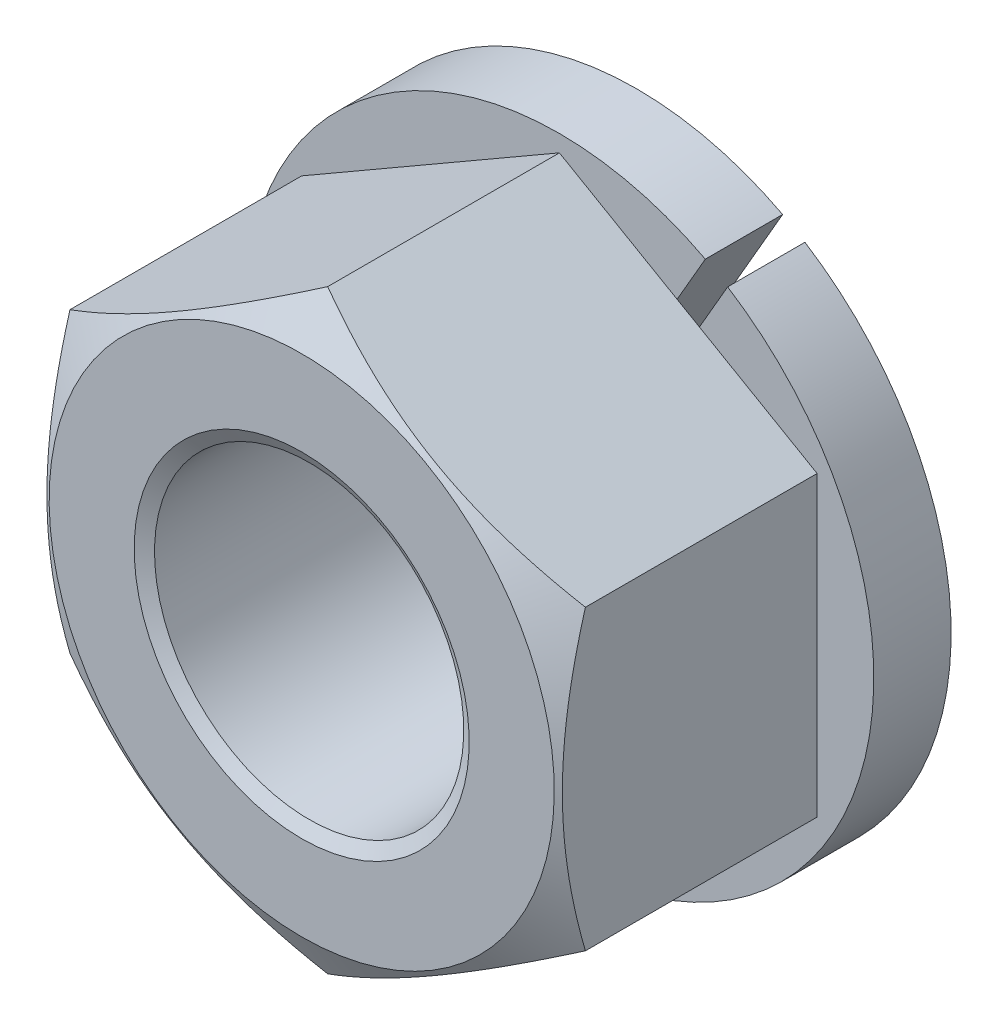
ISO-10303-21;
HEADER;
FILE_DESCRIPTION(('STEP AP214'),'2;1');
FILE_NAME('part.step','',(''),(''),'','','');
FILE_SCHEMA(('AUTOMOTIVE_DESIGN { 1 0 10303 214 1 1 1 1 }'));
ENDSEC;
DATA;
#1=APPLICATION_CONTEXT('core data for automotive mechanical design processes');
#2=APPLICATION_PROTOCOL_DEFINITION('international standard','automotive_design',2000,#1);
#3=PRODUCT_CONTEXT('',#1,'mechanical');
#4=PRODUCT('Part','Part','',(#3));
#5=PRODUCT_RELATED_PRODUCT_CATEGORY('part','',(#4));
#6=PRODUCT_DEFINITION_FORMATION('','',#4);
#7=PRODUCT_DEFINITION_CONTEXT('part definition',#1,'design');
#8=PRODUCT_DEFINITION('design','',#6,#7);
#9=PRODUCT_DEFINITION_SHAPE('','',#8);
#10=(LENGTH_UNIT() NAMED_UNIT(*) SI_UNIT(.MILLI.,.METRE.));
#11=(NAMED_UNIT(*) PLANE_ANGLE_UNIT() SI_UNIT($,.RADIAN.));
#12=(NAMED_UNIT(*) SI_UNIT($,.STERADIAN.) SOLID_ANGLE_UNIT());
#13=UNCERTAINTY_MEASURE_WITH_UNIT(LENGTH_MEASURE(1.E-05),#10,'distance_accuracy_value','');
#14=(GEOMETRIC_REPRESENTATION_CONTEXT(3) GLOBAL_UNCERTAINTY_ASSIGNED_CONTEXT((#13)) GLOBAL_UNIT_ASSIGNED_CONTEXT((#10,
#11,#12)) REPRESENTATION_CONTEXT('',''));
#15=CARTESIAN_POINT('',(0.,0.,0.));
#16=DIRECTION('',(0.,0.,1.));
#17=DIRECTION('',(1.,0.,0.));
#18=AXIS2_PLACEMENT_3D('',#15,#16,#17);
#19=CARTESIAN_POINT('',(5.,-2.88675134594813,1.5));
#20=DIRECTION('',(0.,0.,1.));
#21=DIRECTION('',(-0.866025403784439,0.5,0.));
#22=AXIS2_PLACEMENT_3D('',#19,#20,#21);
#23=PLANE('',#22);
#24=DIRECTION('',(0.5,0.866025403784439,0.));
#25=VECTOR('',#24,1.);
#26=CARTESIAN_POINT('',(1.73637476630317,2.50748931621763,1.5));
#27=LINE('',#26,#25);
#28=CARTESIAN_POINT('',(1.83669152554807,2.68124304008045,1.5));
#29=VERTEX_POINT('',#28);
#30=CARTESIAN_POINT('',(2.71650635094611,4.20512701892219,1.5));
#31=VERTEX_POINT('',#30);
#32=EDGE_CURVE('E9',#29,#31,#27,.T.);
#33=ORIENTED_EDGE('',*,*,#32,.F.);
#34=CARTESIAN_POINT('',(0.,0.,1.5));
#35=DIRECTION('',(0.,0.,1.));
#36=DIRECTION('',(-0.866025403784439,0.5,0.));
#37=AXIS2_PLACEMENT_3D('',#34,#35,#36);
#38=CIRCLE('',#37,3.25);
#39=CARTESIAN_POINT('',(1.40367882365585,2.93124304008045,1.5));
#40=VERTEX_POINT('',#39);
#41=EDGE_CURVE('E315',#29,#40,#38,.T.);
#42=ORIENTED_EDGE('',*,*,#41,.T.);
#43=DIRECTION('',(-0.5,-0.866025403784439,0.));
#44=VECTOR('',#43,1.);
#45=CARTESIAN_POINT('',(1.30336206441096,2.75748931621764,1.5));
#46=LINE('',#45,#44);
#47=CARTESIAN_POINT('',(2.28349364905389,4.45512701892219,1.5));
#48=VERTEX_POINT('',#47);
#49=EDGE_CURVE('E24',#48,#40,#46,.T.);
#50=ORIENTED_EDGE('',*,*,#49,.F.);
#51=DIRECTION('',(-0.866025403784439,0.5,0.));
#52=VECTOR('',#51,1.);
#53=CARTESIAN_POINT('',(5.,2.88675134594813,1.5));
#54=LINE('',#53,#52);
#55=EDGE_CURVE('E311',#31,#48,#54,.T.);
#56=ORIENTED_EDGE('',*,*,#55,.F.);
#57=EDGE_LOOP('',(#33,#42,#50,#56));
#58=FACE_BOUND('',#57,.T.);
#59=ADVANCED_FACE('F14',(#58),#23,.F.);
#60=CARTESIAN_POINT('',(0.,-5.77350269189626,6.5));
#61=DIRECTION('',(-0.5,0.866025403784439,0.));
#62=DIRECTION('',(-0.866025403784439,-0.5,0.));
#63=AXIS2_PLACEMENT_3D('',#60,#61,#62);
#64=PLANE('',#63);
#65=CARTESIAN_POINT('',(-0.000199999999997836,-5.7736181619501,5.99561631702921));
#66=CARTESIAN_POINT('',(0.219534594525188,-5.64675433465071,6.0688784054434));
#67=CARTESIAN_POINT('',(0.441148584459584,-5.5188054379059,6.13551365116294));
#68=CARTESIAN_POINT('',(0.888213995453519,-5.26069210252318,6.25182598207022));
#69=CARTESIAN_POINT('',(1.11367335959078,-5.13052307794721,6.30146192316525));
#70=CARTESIAN_POINT('',(1.56183230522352,-4.87177839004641,6.37871394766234));
#71=CARTESIAN_POINT('',(1.7844620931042,-4.74324302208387,6.40684459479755));
#72=CARTESIAN_POINT('',(2.11918990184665,-4.54998783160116,6.43207005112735));
#73=CARTESIAN_POINT('',(2.23084219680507,-4.48552534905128,6.43765151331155));
#74=CARTESIAN_POINT('',(2.45424997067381,-4.35654081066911,6.44306275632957));
#75=CARTESIAN_POINT('',(2.56600544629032,-4.2920187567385,6.44289271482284));
#76=CARTESIAN_POINT('',(2.87218423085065,-4.11524635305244,6.43451134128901));
#77=CARTESIAN_POINT('',(3.06650608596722,-4.00305457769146,6.42043520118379));
#78=CARTESIAN_POINT('',(3.45386010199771,-3.77941563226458,6.3757997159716));
#79=CARTESIAN_POINT('',(3.64689090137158,-3.66796924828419,6.34522511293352));
#80=CARTESIAN_POINT('',(4.03502534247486,-3.44387972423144,6.26879647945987));
#81=CARTESIAN_POINT('',(4.23007999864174,-3.3312648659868,6.22261859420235));
#82=CARTESIAN_POINT('',(4.61728034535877,-3.10771464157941,6.1178131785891));
#83=CARTESIAN_POINT('',(4.80943099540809,-2.99677641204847,6.05921026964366));
#84=CARTESIAN_POINT('',(5.0002,-2.88663587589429,5.99561631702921));
#85=B_SPLINE_CURVE_WITH_KNOTS('',3,(#65,#66,#67,#68,#69,#70,#71,#72,#73,#74,#75,#76,#77,#78,#79,
#80,#81,#82,#83,#84),.UNSPECIFIED.,.F.,.F.,(4,2,2,2,2,2,2,2,2,4),(0.,0.792555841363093,
1.58701660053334,2.36181537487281,2.74884076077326,3.13585419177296,3.8096236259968,
4.48401723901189,5.17336882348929,5.86136694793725),.UNSPECIFIED.);
#86=CARTESIAN_POINT('',(2.16081492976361E-13,-5.77350269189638,5.995682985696));
#87=VERTEX_POINT('',#86);
#88=CARTESIAN_POINT('',(5.,-2.88675134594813,5.99568298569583));
#89=VERTEX_POINT('',#88);
#90=EDGE_CURVE('E214',#87,#89,#85,.T.);
#91=ORIENTED_EDGE('',*,*,#90,.F.);
#92=DIRECTION('',(0.,0.,-1.));
#93=VECTOR('',#92,1.);
#94=CARTESIAN_POINT('',(0.,-5.77350269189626,6.5));
#95=LINE('',#94,#93);
#96=CARTESIAN_POINT('',(0.,-5.77350269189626,1.5));
#97=VERTEX_POINT('',#96);
#98=EDGE_CURVE('E302',#87,#97,#95,.T.);
#99=ORIENTED_EDGE('',*,*,#98,.T.);
#100=DIRECTION('',(0.866025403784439,0.5,0.));
#101=VECTOR('',#100,1.);
#102=CARTESIAN_POINT('',(0.,-5.77350269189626,1.5));
#103=LINE('',#102,#101);
#104=CARTESIAN_POINT('',(5.,-2.88675134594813,1.5));
#105=VERTEX_POINT('',#104);
#106=EDGE_CURVE('E289',#97,#105,#103,.T.);
#107=ORIENTED_EDGE('',*,*,#106,.T.);
#108=DIRECTION('',(0.,0.,-1.));
#109=VECTOR('',#108,1.);
#110=CARTESIAN_POINT('',(5.,-2.88675134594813,6.5));
#111=LINE('',#110,#109);
#112=EDGE_CURVE('E286',#89,#105,#111,.T.);
#113=ORIENTED_EDGE('',*,*,#112,.F.);
#114=EDGE_LOOP('',(#91,#99,#107,#113));
#115=FACE_BOUND('',#114,.T.);
#116=ADVANCED_FACE('F16',(#115),#64,.F.);
#117=CARTESIAN_POINT('',(5.,-2.88675134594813,6.5));
#118=DIRECTION('',(-1.,0.,0.));
#119=DIRECTION('',(0.,-1.,0.));
#120=AXIS2_PLACEMENT_3D('',#117,#118,#119);
#121=PLANE('',#120);
#122=CARTESIAN_POINT('',(5.,-2.8869822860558,5.99561631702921));
#123=CARTESIAN_POINT('',(5.,-2.63325463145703,6.0688784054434));
#124=CARTESIAN_POINT('',(5.,-2.37735683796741,6.13551365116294));
#125=CARTESIAN_POINT('',(5.,-1.86113016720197,6.25182598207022));
#126=CARTESIAN_POINT('',(5.,-1.60079211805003,6.30146192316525));
#127=CARTESIAN_POINT('',(5.,-1.08330274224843,6.37871394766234));
#128=CARTESIAN_POINT('',(5.,-0.826232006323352,6.40684459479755));
#129=CARTESIAN_POINT('',(5.,-0.439721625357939,6.43207005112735));
#130=CARTESIAN_POINT('',(5.,-0.310796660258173,6.43765151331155));
#131=CARTESIAN_POINT('',(5.,-0.0528275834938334,6.44306275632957));
#132=CARTESIAN_POINT('',(5.,0.0762165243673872,6.44289271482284));
#133=CARTESIAN_POINT('',(5.,0.429761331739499,6.43451134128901));
#134=CARTESIAN_POINT('',(5.,0.654144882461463,6.42043520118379));
#135=CARTESIAN_POINT('',(5.,1.10142277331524,6.3757997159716));
#136=CARTESIAN_POINT('',(5.,1.32431554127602,6.34522511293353));
#137=CARTESIAN_POINT('',(5.,1.77249458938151,6.26879647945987));
#138=CARTESIAN_POINT('',(5.,1.99772430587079,6.22261859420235));
#139=CARTESIAN_POINT('',(5.,2.44482475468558,6.1178131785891));
#140=CARTESIAN_POINT('',(5.,2.66670121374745,6.05921026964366));
#141=CARTESIAN_POINT('',(5.,2.8869822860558,5.99561631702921));
#142=B_SPLINE_CURVE_WITH_KNOTS('',3,(#122,#123,#124,#125,#126,#127,#128,#129,#130,#131,#132,
#133,#134,#135,#136,#137,#138,#139,#140,#141),.UNSPECIFIED.,.F.,.F.,(4,2,2,2,2,2,2,2,2,4),(0.,
0.79255584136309,1.58701660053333,2.3618153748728,2.74884076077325,3.13585419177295,
3.80962362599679,4.48401723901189,5.17336882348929,5.86136694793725),.UNSPECIFIED.);
#143=CARTESIAN_POINT('',(5.00000000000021,2.886751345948,5.995682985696));
#144=VERTEX_POINT('',#143);
#145=EDGE_CURVE('E208',#89,#144,#142,.T.);
#146=ORIENTED_EDGE('',*,*,#145,.F.);
#147=ORIENTED_EDGE('',*,*,#112,.T.);
#148=DIRECTION('',(0.,1.,0.));
#149=VECTOR('',#148,1.);
#150=CARTESIAN_POINT('',(5.,-2.88675134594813,1.5));
#151=LINE('',#150,#149);
#152=CARTESIAN_POINT('',(5.,2.88675134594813,1.5));
#153=VERTEX_POINT('',#152);
#154=EDGE_CURVE('E312',#105,#153,#151,.T.);
#155=ORIENTED_EDGE('',*,*,#154,.T.);
#156=DIRECTION('',(0.,0.,-1.));
#157=VECTOR('',#156,1.);
#158=CARTESIAN_POINT('',(5.,2.88675134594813,6.5));
#159=LINE('',#158,#157);
#160=EDGE_CURVE('E287',#144,#153,#159,.T.);
#161=ORIENTED_EDGE('',*,*,#160,.F.);
#162=EDGE_LOOP('',(#146,#147,#155,#161));
#163=FACE_BOUND('',#162,.T.);
#164=ADVANCED_FACE('F220',(#163),#121,.F.);
#165=CARTESIAN_POINT('',(5.,2.88675134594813,6.5));
#166=DIRECTION('',(-0.5,-0.866025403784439,0.));
#167=DIRECTION('',(0.866025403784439,-0.5,0.));
#168=AXIS2_PLACEMENT_3D('',#165,#166,#167);
#169=PLANE('',#168);
#170=CARTESIAN_POINT('',(9.31461305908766,0.395708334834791,3.94637132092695));
#171=CARTESIAN_POINT('',(9.12460591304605,0.50540901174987,4.0532566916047));
#172=CARTESIAN_POINT('',(8.9341730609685,0.615355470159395,4.1591497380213));
#173=CARTESIAN_POINT('',(8.55222987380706,0.835870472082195,4.36839518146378));
#174=CARTESIAN_POINT('',(8.36071938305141,0.946439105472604,4.47174719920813));
#175=CARTESIAN_POINT('',(7.97545525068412,1.16887145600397,4.67585010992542));
#176=CARTESIAN_POINT('',(7.78169512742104,1.28073891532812,4.77658474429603));
#177=CARTESIAN_POINT('',(7.39266783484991,1.50534392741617,4.97408111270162));
#178=CARTESIAN_POINT('',(7.19740073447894,1.61808144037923,5.07084302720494));
#179=CARTESIAN_POINT('',(6.79843083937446,1.84842681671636,5.26252842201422));
#180=CARTESIAN_POINT('',(6.59466568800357,1.96607068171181,5.35727976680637));
#181=CARTESIAN_POINT('',(6.18478852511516,2.20271337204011,5.53988499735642));
#182=CARTESIAN_POINT('',(5.97867625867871,2.32171234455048,5.62773812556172));
#183=CARTESIAN_POINT('',(5.56413143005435,2.56104991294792,5.79432472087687));
#184=CARTESIAN_POINT('',(5.35570419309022,2.68138543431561,5.87307568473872));
#185=CARTESIAN_POINT('',(4.93586154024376,2.9237817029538,6.01900730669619));
#186=CARTESIAN_POINT('',(4.72444705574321,3.04584191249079,6.08619148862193));
#187=CARTESIAN_POINT('',(4.29967538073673,3.2910839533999,6.20548654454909));
#188=CARTESIAN_POINT('',(4.0863361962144,3.41425538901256,6.2576813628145));
#189=CARTESIAN_POINT('',(3.65690409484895,3.66218812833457,6.3441196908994));
#190=CARTESIAN_POINT('',(3.44081147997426,3.78694925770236,6.37836515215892));
#191=CARTESIAN_POINT('',(3.00981432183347,4.03578558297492,6.42573034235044));
#192=CARTESIAN_POINT('',(2.79493348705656,4.15984709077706,6.43913060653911));
#193=CARTESIAN_POINT('',(2.36495033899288,4.40809797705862,6.4444155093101));
#194=CARTESIAN_POINT('',(2.14984802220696,4.53228735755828,6.43629980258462));
#195=CARTESIAN_POINT('',(1.78760186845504,4.74143027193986,6.40509926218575));
#196=CARTESIAN_POINT('',(1.64008376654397,4.82659988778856,6.38744135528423));
#197=CARTESIAN_POINT('',(1.34606931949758,4.99634920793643,6.34304431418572));
#198=CARTESIAN_POINT('',(1.19957310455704,5.08092883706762,6.31630404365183));
#199=CARTESIAN_POINT('',(0.761849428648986,5.3336487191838,6.22385834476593));
#200=CARTESIAN_POINT('',(0.472531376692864,5.50068657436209,6.14594218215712));
#201=CARTESIAN_POINT('',(0.0396839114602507,5.75059117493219,6.00995186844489));
#202=CARTESIAN_POINT('',(-0.10606671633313,5.83474033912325,5.96076007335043));
#203=CARTESIAN_POINT('',(-0.396153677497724,6.00222212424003,5.85705069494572));
#204=CARTESIAN_POINT('',(-0.54048999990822,6.08555473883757,5.8025330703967));
#205=CARTESIAN_POINT('',(-0.827792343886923,6.25142882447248,5.68906484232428));
#206=CARTESIAN_POINT('',(-0.970758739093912,6.33397051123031,5.63011548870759));
#207=CARTESIAN_POINT('',(-1.25549284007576,6.49836182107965,5.50849897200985));
#208=CARTESIAN_POINT('',(-1.39726057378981,6.58021146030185,5.44583189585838));
#209=CARTESIAN_POINT('',(-1.78086622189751,6.8016862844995,5.27141395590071));
#210=CARTESIAN_POINT('',(-2.02167449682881,6.94071700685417,5.15664646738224));
#211=CARTESIAN_POINT('',(-2.50079436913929,7.21733699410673,4.92033693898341));
#212=CARTESIAN_POINT('',(-2.73910568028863,7.35492609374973,4.79879413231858));
#213=CARTESIAN_POINT('',(-3.21380958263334,7.62899651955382,4.55054835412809));
#214=CARTESIAN_POINT('',(-3.45020138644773,7.76547739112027,4.42384338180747));
#215=CARTESIAN_POINT('',(-3.92136281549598,8.03750256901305,4.16651599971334));
#216=CARTESIAN_POINT('',(-4.15613250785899,8.1730469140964,4.03589375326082));
#217=CARTESIAN_POINT('',(-4.6247554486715,8.44360649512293,3.77137602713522));
#218=CARTESIAN_POINT('',(-4.85860658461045,8.57862051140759,3.63747556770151));
#219=CARTESIAN_POINT('',(-5.32525183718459,8.84803827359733,3.36723982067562));
#220=CARTESIAN_POINT('',(-5.55804594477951,8.98244201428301,3.23090451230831));
#221=CARTESIAN_POINT('',(-6.25503438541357,9.38484847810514,2.81905649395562));
#222=CARTESIAN_POINT('',(-6.71794160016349,9.65210808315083,2.54064083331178));
#223=CARTESIAN_POINT('',(-7.59209185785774,10.1567989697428,2.0086566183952));
#224=CARTESIAN_POINT('',(-8.00357388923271,10.3943682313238,1.75560912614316));
#225=CARTESIAN_POINT('',(-8.8251636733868,10.8687133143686,1.24648699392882));
#226=CARTESIAN_POINT('',(-9.23527133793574,11.1054890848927,0.990412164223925));
#227=CARTESIAN_POINT('',(-10.0530448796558,11.5776308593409,0.476895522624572));
#228=CARTESIAN_POINT('',(-10.4607143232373,11.8129989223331,0.219461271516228));
#229=CARTESIAN_POINT('',(-11.2751958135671,12.283240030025,-0.297121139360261));
#230=CARTESIAN_POINT('',(-11.6820079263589,12.5181131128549,-0.556269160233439));
#231=CARTESIAN_POINT('',(-12.0885194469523,12.7528126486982,-0.81604048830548));
#232=B_SPLINE_CURVE_WITH_KNOTS('',3,(#170,#171,#172,#173,#174,#175,#176,#177,#178,#179,#180,
#181,#182,#183,#184,#185,#186,#187,#188,#189,#190,#191,#192,#193,#194,#195,#196,#197,#198,#199,
#200,#201,#202,#203,#204,#205,#206,#207,#208,#209,#210,#211,#212,#213,#214,#215,#216,#217,#218,
#219,#220,#221,#222,#223,#224,#225,#226,#227,#228,#229,#230,#231),.UNSPECIFIED.,.F.,.F.,(4,2,2,
2,2,2,2,2,2,2,2,2,2,2,2,2,2,2,2,2,2,2,2,2,2,2,2,2,2,2,4),(0.,0.732164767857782,1.46443816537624,
2.20050705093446,2.93654246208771,3.69740767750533,4.45835633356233,5.21781702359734,
5.9770459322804,6.73193613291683,7.48674424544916,8.23130343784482,8.9758745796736,
9.48938382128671,10.0029573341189,11.0306042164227,11.5565767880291,12.0825534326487,
12.6083822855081,13.1341988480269,14.0365093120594,14.9389221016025,15.8416880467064,
16.7444164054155,17.648613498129,18.5528183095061,20.3608155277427,21.9757678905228,
23.5908220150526,25.2004094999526,26.8098680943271),.UNSPECIFIED.);
#233=CARTESIAN_POINT('',(0.,5.77350269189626,5.99568298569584));
#234=VERTEX_POINT('',#233);
#235=EDGE_CURVE('E202',#144,#234,#232,.T.);
#236=ORIENTED_EDGE('',*,*,#235,.F.);
#237=ORIENTED_EDGE('',*,*,#160,.T.);
#238=EDGE_CURVE('E41',#153,#31,#54,.T.);
#239=ORIENTED_EDGE('',*,*,#238,.T.);
#240=ORIENTED_EDGE('',*,*,#55,.T.);
#241=CARTESIAN_POINT('',(0.,5.77350269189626,1.5));
#242=VERTEX_POINT('',#241);
#243=EDGE_CURVE('E116',#48,#242,#54,.T.);
#244=ORIENTED_EDGE('',*,*,#243,.T.);
#245=DIRECTION('',(0.,0.,-1.));
#246=VECTOR('',#245,1.);
#247=CARTESIAN_POINT('',(0.,5.77350269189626,6.5));
#248=LINE('',#247,#246);
#249=EDGE_CURVE('E291',#234,#242,#248,.T.);
#250=ORIENTED_EDGE('',*,*,#249,.F.);
#251=EDGE_LOOP('',(#236,#237,#239,#240,#244,#250));
#252=FACE_BOUND('',#251,.T.);
#253=ADVANCED_FACE('F193',(#252),#169,.F.);
#254=CARTESIAN_POINT('',(0.,5.77350269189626,6.5));
#255=DIRECTION('',(0.5,-0.866025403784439,0.));
#256=DIRECTION('',(0.866025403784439,0.5,0.));
#257=AXIS2_PLACEMENT_3D('',#254,#255,#256);
#258=PLANE('',#257);
#259=CARTESIAN_POINT('',(0.00020000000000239,5.7736181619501,5.99561631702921));
#260=CARTESIAN_POINT('',(-0.219534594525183,5.64675433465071,6.0688784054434));
#261=CARTESIAN_POINT('',(-0.44114858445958,5.5188054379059,6.13551365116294));
#262=CARTESIAN_POINT('',(-0.888213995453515,5.26069210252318,6.25182598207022));
#263=CARTESIAN_POINT('',(-1.11367335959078,5.13052307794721,6.30146192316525));
#264=CARTESIAN_POINT('',(-1.56183230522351,4.87177839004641,6.37871394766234));
#265=CARTESIAN_POINT('',(-1.7844620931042,4.74324302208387,6.40684459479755));
#266=CARTESIAN_POINT('',(-2.11918990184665,4.54998783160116,6.43207005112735));
#267=CARTESIAN_POINT('',(-2.23084219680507,4.48552534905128,6.43765151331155));
#268=CARTESIAN_POINT('',(-2.4542499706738,4.35654081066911,6.44306275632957));
#269=CARTESIAN_POINT('',(-2.56600544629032,4.29201875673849,6.44289271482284));
#270=CARTESIAN_POINT('',(-2.87218423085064,4.11524635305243,6.43451134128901));
#271=CARTESIAN_POINT('',(-3.06650608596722,4.00305457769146,6.42043520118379));
#272=CARTESIAN_POINT('',(-3.45386010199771,3.77941563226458,6.3757997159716));
#273=CARTESIAN_POINT('',(-3.64689090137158,3.66796924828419,6.34522511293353));
#274=CARTESIAN_POINT('',(-4.03502534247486,3.44387972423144,6.26879647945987));
#275=CARTESIAN_POINT('',(-4.23007999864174,3.3312648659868,6.22261859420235));
#276=CARTESIAN_POINT('',(-4.61728034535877,3.10771464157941,6.1178131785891));
#277=CARTESIAN_POINT('',(-4.80943099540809,2.99677641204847,6.05921026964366));
#278=CARTESIAN_POINT('',(-5.0002,2.88663587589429,5.99561631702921));
#279=B_SPLINE_CURVE_WITH_KNOTS('',3,(#259,#260,#261,#262,#263,#264,#265,#266,#267,#268,#269,
#270,#271,#272,#273,#274,#275,#276,#277,#278),.UNSPECIFIED.,.F.,.F.,(4,2,2,2,2,2,2,2,2,4),(0.,
0.792555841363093,1.58701660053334,2.36181537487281,2.74884076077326,3.13585419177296,
3.8096236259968,4.4840172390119,5.17336882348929,5.86136694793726),.UNSPECIFIED.);
#280=CARTESIAN_POINT('',(-5.,2.88675134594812,5.99568298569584));
#281=VERTEX_POINT('',#280);
#282=EDGE_CURVE('E196',#234,#281,#279,.T.);
#283=ORIENTED_EDGE('',*,*,#282,.F.);
#284=ORIENTED_EDGE('',*,*,#249,.T.);
#285=DIRECTION('',(-0.866025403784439,-0.5,0.));
#286=VECTOR('',#285,1.);
#287=CARTESIAN_POINT('',(0.,5.77350269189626,1.5));
#288=LINE('',#287,#286);
#289=CARTESIAN_POINT('',(-5.,2.88675134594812,1.5));
#290=VERTEX_POINT('',#289);
#291=EDGE_CURVE('E308',#242,#290,#288,.T.);
#292=ORIENTED_EDGE('',*,*,#291,.T.);
#293=DIRECTION('',(0.,0.,-1.));
#294=VECTOR('',#293,1.);
#295=CARTESIAN_POINT('',(-5.,2.88675134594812,6.5));
#296=LINE('',#295,#294);
#297=EDGE_CURVE('E296',#281,#290,#296,.T.);
#298=ORIENTED_EDGE('',*,*,#297,.F.);
#299=EDGE_LOOP('',(#283,#284,#292,#298));
#300=FACE_BOUND('',#299,.T.);
#301=ADVANCED_FACE('F188',(#300),#258,.F.);
#302=CARTESIAN_POINT('',(-5.,2.88675134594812,6.5));
#303=DIRECTION('',(1.,0.,0.));
#304=DIRECTION('',(0.,1.,0.));
#305=AXIS2_PLACEMENT_3D('',#302,#303,#304);
#306=PLANE('',#305);
#307=CARTESIAN_POINT('',(-5.,2.8869822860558,5.99561631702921));
#308=CARTESIAN_POINT('',(-5.,2.63325463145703,6.0688784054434));
#309=CARTESIAN_POINT('',(-5.,2.37735683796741,6.13551365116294));
#310=CARTESIAN_POINT('',(-5.,1.86113016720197,6.25182598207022));
#311=CARTESIAN_POINT('',(-5.,1.60079211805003,6.30146192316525));
#312=CARTESIAN_POINT('',(-5.,1.08330274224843,6.37871394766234));
#313=CARTESIAN_POINT('',(-5.,0.826232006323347,6.40684459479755));
#314=CARTESIAN_POINT('',(-5.,0.439721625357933,6.43207005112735));
#315=CARTESIAN_POINT('',(-5.,0.310796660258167,6.43765151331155));
#316=CARTESIAN_POINT('',(-5.,0.0528275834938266,6.44306275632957));
#317=CARTESIAN_POINT('',(-5.,-0.0762165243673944,6.44289271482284));
#318=CARTESIAN_POINT('',(-5.,-0.429761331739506,6.43451134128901));
#319=CARTESIAN_POINT('',(-5.,-0.654144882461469,6.42043520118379));
#320=CARTESIAN_POINT('',(-5.,-1.10142277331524,6.3757997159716));
#321=CARTESIAN_POINT('',(-5.,-1.32431554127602,6.34522511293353));
#322=CARTESIAN_POINT('',(-5.,-1.77249458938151,6.26879647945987));
#323=CARTESIAN_POINT('',(-5.,-1.99772430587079,6.22261859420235));
#324=CARTESIAN_POINT('',(-5.,-2.44482475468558,6.1178131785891));
#325=CARTESIAN_POINT('',(-5.,-2.66670121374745,6.05921026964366));
#326=CARTESIAN_POINT('',(-5.,-2.8869822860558,5.99561631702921));
#327=B_SPLINE_CURVE_WITH_KNOTS('',3,(#307,#308,#309,#310,#311,#312,#313,#314,#315,#316,#317,
#318,#319,#320,#321,#322,#323,#324,#325,#326),.UNSPECIFIED.,.F.,.F.,(4,2,2,2,2,2,2,2,2,4),(0.,
0.792555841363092,1.58701660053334,2.36181537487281,2.74884076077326,3.13585419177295,
3.8096236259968,4.48401723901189,5.17336882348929,5.86136694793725),.UNSPECIFIED.);
#328=CARTESIAN_POINT('',(-5.,-2.88675134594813,5.99568298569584));
#329=VERTEX_POINT('',#328);
#330=EDGE_CURVE('E166',#281,#329,#327,.T.);
#331=ORIENTED_EDGE('',*,*,#330,.F.);
#332=ORIENTED_EDGE('',*,*,#297,.T.);
#333=DIRECTION('',(0.,-1.,0.));
#334=VECTOR('',#333,1.);
#335=CARTESIAN_POINT('',(-5.,2.88675134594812,1.5));
#336=LINE('',#335,#334);
#337=CARTESIAN_POINT('',(-5.,-2.88675134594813,1.5));
#338=VERTEX_POINT('',#337);
#339=EDGE_CURVE('E306',#290,#338,#336,.T.);
#340=ORIENTED_EDGE('',*,*,#339,.T.);
#341=DIRECTION('',(0.,0.,-1.));
#342=VECTOR('',#341,1.);
#343=CARTESIAN_POINT('',(-5.,-2.88675134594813,6.5));
#344=LINE('',#343,#342);
#345=EDGE_CURVE('E299',#329,#338,#344,.T.);
#346=ORIENTED_EDGE('',*,*,#345,.F.);
#347=EDGE_LOOP('',(#331,#332,#340,#346));
#348=FACE_BOUND('',#347,.T.);
#349=ADVANCED_FACE('F182',(#348),#306,.F.);
#350=CARTESIAN_POINT('',(-5.,-2.88675134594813,6.5));
#351=DIRECTION('',(0.5,0.866025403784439,0.));
#352=DIRECTION('',(-0.866025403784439,0.5,0.));
#353=AXIS2_PLACEMENT_3D('',#350,#351,#352);
#354=PLANE('',#353);
#355=CARTESIAN_POINT('',(4.31461305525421,-8.26454570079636,3.94637132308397));
#356=CARTESIAN_POINT('',(4.12460590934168,-8.1548450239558,4.05325669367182));
#357=CARTESIAN_POINT('',(3.9341730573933,-8.04489856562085,4.15914973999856));
#358=CARTESIAN_POINT('',(3.55222987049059,-7.82438356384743,4.36839518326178));
#359=CARTESIAN_POINT('',(3.3607193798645,-7.71381493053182,4.47174720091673));
#360=CARTESIAN_POINT('',(2.97545524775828,-7.49138258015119,4.67585011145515));
#361=CARTESIAN_POINT('',(2.78169512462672,-7.37951512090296,4.77658474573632));
#362=CARTESIAN_POINT('',(2.39266783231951,-7.15491010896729,4.9740811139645));
#363=CARTESIAN_POINT('',(2.19740073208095,-7.04217259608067,5.07084302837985));
#364=CARTESIAN_POINT('',(1.79843083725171,-6.81182721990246,5.26252842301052));
#365=CARTESIAN_POINT('',(1.59466568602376,-6.69418335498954,5.35727976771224));
#366=CARTESIAN_POINT('',(1.18478852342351,-6.4575406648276,5.53988499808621));
#367=CARTESIAN_POINT('',(0.97867625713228,-6.33854169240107,5.62773812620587));
#368=CARTESIAN_POINT('',(0.564131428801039,-6.09920412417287,5.79432472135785));
#369=CARTESIAN_POINT('',(0.355704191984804,-5.97886860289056,5.87307568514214));
#370=CARTESIAN_POINT('',(-0.0641384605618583,-5.73647233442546,6.01900730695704));
#371=CARTESIAN_POINT('',(-0.275552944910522,-5.61441212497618,6.08619148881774));
#372=CARTESIAN_POINT('',(-0.700324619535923,-5.36917008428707,6.20548654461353));
#373=CARTESIAN_POINT('',(-0.913663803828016,-5.24599864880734,6.25768136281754));
#374=CARTESIAN_POINT('',(-1.34309590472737,-4.99806590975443,6.34411969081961));
#375=CARTESIAN_POINT('',(-1.5591885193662,-4.87330478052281,6.37836515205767));
#376=CARTESIAN_POINT('',(-1.99018567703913,-4.62446845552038,6.42573034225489));
#377=CARTESIAN_POINT('',(-2.20506651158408,-4.50040694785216,6.4391306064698));
#378=CARTESIAN_POINT('',(-2.63504965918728,-4.25215606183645,6.44441550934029));
#379=CARTESIAN_POINT('',(-2.8501519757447,-4.12796668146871,6.43629980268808));
#380=CARTESIAN_POINT('',(-3.21239812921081,-3.91882376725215,6.40509926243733));
#381=CARTESIAN_POINT('',(-3.359916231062,-3.83365415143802,6.38744135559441));
#382=CARTESIAN_POINT('',(-3.65393067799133,-3.66390483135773,6.3430443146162));
#383=CARTESIAN_POINT('',(-3.8004268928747,-3.57932520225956,6.316304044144));
#384=CARTESIAN_POINT('',(-4.23815056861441,-3.32660532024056,6.22385834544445));
#385=CARTESIAN_POINT('',(-4.5274686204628,-3.15956746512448,6.14594218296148));
#386=CARTESIAN_POINT('',(-4.96031608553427,-2.90966286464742,6.00995186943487));
#387=CARTESIAN_POINT('',(-5.10606671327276,-2.82551370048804,5.96076007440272));
#388=CARTESIAN_POINT('',(-5.39615367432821,-2.65803191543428,5.85705069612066));
#389=CARTESIAN_POINT('',(-5.54048999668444,-2.57469930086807,5.802533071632));
#390=CARTESIAN_POINT('',(-5.82779234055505,-2.40882521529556,5.6890648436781));
#391=CARTESIAN_POINT('',(-5.97075873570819,-2.32628352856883,5.63011549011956));
#392=CARTESIAN_POINT('',(-6.25549283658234,-2.16189221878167,5.50849897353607));
#393=CARTESIAN_POINT('',(-6.39726057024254,-2.08004257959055,5.44583189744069));
#394=CARTESIAN_POINT('',(-6.78086621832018,-1.85856775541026,5.27141395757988));
#395=CARTESIAN_POINT('',(-7.02167449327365,-1.71953703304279,5.15664646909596));
#396=CARTESIAN_POINT('',(-7.50079436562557,-1.44291704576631,4.92033694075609));
#397=CARTESIAN_POINT('',(-7.7391056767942,-1.30532794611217,4.79879413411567));
#398=CARTESIAN_POINT('',(-8.21380957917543,-1.031257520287,4.55054835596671));
#399=CARTESIAN_POINT('',(-8.45020138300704,-0.894776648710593,4.42384338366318));
#400=CARTESIAN_POINT('',(-8.92136281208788,-0.622751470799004,4.16651600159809));
#401=CARTESIAN_POINT('',(-9.15613250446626,-0.487207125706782,4.03589375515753));
#402=CARTESIAN_POINT('',(-9.62475544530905,-0.216647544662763,3.77137602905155));
#403=CARTESIAN_POINT('',(-9.85860658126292,-0.0816335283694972,3.63747556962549));
#404=CARTESIAN_POINT('',(-10.3252518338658,0.187784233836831,3.36723982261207));
#405=CARTESIAN_POINT('',(-10.5580459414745,0.322187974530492,3.2309045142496));
#406=CARTESIAN_POINT('',(-11.2550343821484,0.724594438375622,2.81905649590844));
#407=CARTESIAN_POINT('',(-11.7179415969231,0.991854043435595,2.54064083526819));
#408=CARTESIAN_POINT('',(-12.5920918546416,1.49654493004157,2.00865662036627));
#409=CARTESIAN_POINT('',(-13.0035738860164,1.73411419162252,1.75560912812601));
#410=CARTESIAN_POINT('',(-13.8251636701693,2.20845927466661,1.24648699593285));
#411=CARTESIAN_POINT('',(-14.2352713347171,2.44523504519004,0.990412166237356));
#412=CARTESIAN_POINT('',(-15.0530448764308,2.91737681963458,0.476895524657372));
#413=CARTESIAN_POINT('',(-15.460714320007,3.15274488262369,0.219461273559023));
#414=CARTESIAN_POINT('',(-16.2751958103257,3.62298599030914,-0.297121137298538));
#415=CARTESIAN_POINT('',(-16.6820079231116,3.85785907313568,-0.556269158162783));
#416=CARTESIAN_POINT('',(-17.088519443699,4.09255860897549,-0.816040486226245));
#417=B_SPLINE_CURVE_WITH_KNOTS('',3,(#355,#356,#357,#358,#359,#360,#361,#362,#363,#364,#365,
#366,#367,#368,#369,#370,#371,#372,#373,#374,#375,#376,#377,#378,#379,#380,#381,#382,#383,#384,
#385,#386,#387,#388,#389,#390,#391,#392,#393,#394,#395,#396,#397,#398,#399,#400,#401,#402,#403,
#404,#405,#406,#407,#408,#409,#410,#411,#412,#413,#414,#415,#416),.UNSPECIFIED.,.F.,.F.,(4,2,2,
2,2,2,2,2,2,2,2,2,2,2,2,2,2,2,2,2,2,2,2,2,2,2,2,2,2,2,4),(0.,0.732164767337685,1.46443816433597,
2.2005070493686,2.93654245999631,3.69740767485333,4.45835633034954,5.21781701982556,
5.97704592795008,6.73193612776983,7.48674423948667,8.23130343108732,8.97587457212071,
9.4893838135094,10.0029573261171,11.0306042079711,11.5565767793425,12.082553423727,
12.608382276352,13.1341988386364,14.0365093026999,14.9389220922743,15.8416880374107,
16.7444163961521,17.6486134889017,18.5528183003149,20.3608155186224,21.9757678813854,
23.5908220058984,25.200409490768,26.8098680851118),.UNSPECIFIED.);
#418=EDGE_CURVE('E158',#329,#87,#417,.F.);
#419=ORIENTED_EDGE('',*,*,#418,.F.);
#420=ORIENTED_EDGE('',*,*,#345,.T.);
#421=DIRECTION('',(0.866025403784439,-0.5,0.));
#422=VECTOR('',#421,1.);
#423=CARTESIAN_POINT('',(-5.,-2.88675134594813,1.5));
#424=LINE('',#423,#422);
#425=EDGE_CURVE('E304',#338,#97,#424,.T.);
#426=ORIENTED_EDGE('',*,*,#425,.T.);
#427=ORIENTED_EDGE('',*,*,#98,.F.);
#428=EDGE_LOOP('',(#419,#420,#426,#427));
#429=FACE_BOUND('',#428,.T.);
#430=ADVANCED_FACE('F177',(#429),#354,.F.);
#431=CARTESIAN_POINT('',(5.,-2.88675134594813,6.5));
#432=DIRECTION('',(0.,0.,1.));
#433=DIRECTION('',(-0.866025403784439,0.5,0.));
#434=AXIS2_PLACEMENT_3D('',#431,#432,#433);
#435=PLANE('',#434);
#436=CARTESIAN_POINT('',(0.,0.,6.5));
#437=DIRECTION('',(0.,0.,1.));
#438=DIRECTION('',(-0.866025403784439,0.5,0.));
#439=AXIS2_PLACEMENT_3D('',#436,#437,#438);
#440=CIRCLE('',#439,3.25);
#441=CARTESIAN_POINT('',(-2.81458256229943,1.625,6.5));
#442=VERTEX_POINT('',#441);
#443=EDGE_CURVE('E283',#442,#442,#440,.T.);
#444=ORIENTED_EDGE('',*,*,#443,.F.);
#445=EDGE_LOOP('',(#444));
#446=FACE_BOUND('',#445,.T.);
#447=CARTESIAN_POINT('',(0.,0.,6.5));
#448=DIRECTION('',(0.,0.,1.));
#449=DIRECTION('',(-0.866025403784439,0.5,0.));
#450=AXIS2_PLACEMENT_3D('',#447,#448,#449);
#451=CIRCLE('',#450,4.9);
#452=CARTESIAN_POINT('',(-4.24352447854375,2.45,6.5));
#453=VERTEX_POINT('',#452);
#454=EDGE_CURVE('E129',#453,#453,#451,.T.);
#455=ORIENTED_EDGE('',*,*,#454,.T.);
#456=EDGE_LOOP('',(#455));
#457=FACE_BOUND('',#456,.T.);
#458=ADVANCED_FACE('F181',(#446,#457),#435,.T.);
#459=CARTESIAN_POINT('',(0.,0.,1.93301270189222));
#460=DIRECTION('',(0.,0.,-1.));
#461=DIRECTION('',(0.866025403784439,-0.5,0.));
#462=AXIS2_PLACEMENT_3D('',#459,#460,#461);
#463=CONICAL_SURFACE('',#462,2.5,1.0471975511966);
#464=CARTESIAN_POINT('',(0.,0.,1.6443375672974));
#465=DIRECTION('',(0.,0.,-1.));
#466=DIRECTION('',(-0.866025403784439,0.5,0.));
#467=AXIS2_PLACEMENT_3D('',#464,#465,#466);
#468=CIRCLE('',#467,3.);
#469=CARTESIAN_POINT('',(-2.59807621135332,1.5,1.6443375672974));
#470=VERTEX_POINT('',#469);
#471=EDGE_CURVE('E136',#470,#470,#468,.F.);
#472=ORIENTED_EDGE('',*,*,#471,.T.);
#473=EDGE_LOOP('',(#472));
#474=FACE_BOUND('',#473,.T.);
#475=ORIENTED_EDGE('',*,*,#41,.F.);
#476=EDGE_CURVE('E316',#40,#29,#38,.T.);
#477=ORIENTED_EDGE('',*,*,#476,.F.);
#478=EDGE_LOOP('',(#475,#477));
#479=FACE_BOUND('',#478,.T.);
#480=ADVANCED_FACE('F273',(#474,#479),#463,.F.);
#481=CARTESIAN_POINT('',(0.,0.,6.5));
#482=DIRECTION('',(0.,0.,1.));
#483=DIRECTION('',(-0.866025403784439,0.5,0.));
#484=AXIS2_PLACEMENT_3D('',#481,#482,#483);
#485=CONICAL_SURFACE('',#484,3.25,1.0471975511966);
#486=CARTESIAN_POINT('',(0.,0.,6.35566243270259));
#487=DIRECTION('',(0.,0.,1.));
#488=DIRECTION('',(0.866025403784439,-0.5,0.));
#489=AXIS2_PLACEMENT_3D('',#486,#487,#488);
#490=CIRCLE('',#489,3.);
#491=CARTESIAN_POINT('',(2.59807621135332,-1.5,6.35566243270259));
#492=VERTEX_POINT('',#491);
#493=EDGE_CURVE('E19',#492,#492,#490,.F.);
#494=ORIENTED_EDGE('',*,*,#493,.T.);
#495=EDGE_LOOP('',(#494));
#496=FACE_BOUND('',#495,.T.);
#497=ORIENTED_EDGE('',*,*,#443,.T.);
#498=EDGE_LOOP('',(#497));
#499=FACE_BOUND('',#498,.T.);
#500=ADVANCED_FACE('F267',(#496,#499),#485,.F.);
#501=CARTESIAN_POINT('',(0.,0.,6.5));
#502=DIRECTION('',(0.,0.,-1.));
#503=DIRECTION('',(0.866025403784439,-0.5,0.));
#504=AXIS2_PLACEMENT_3D('',#501,#502,#503);
#505=CONICAL_SURFACE('',#504,4.9,1.0471975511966);
#506=ORIENTED_EDGE('',*,*,#454,.F.);
#507=EDGE_LOOP('',(#506));
#508=FACE_BOUND('',#507,.T.);
#509=ORIENTED_EDGE('',*,*,#90,.T.);
#510=ORIENTED_EDGE('',*,*,#145,.T.);
#511=ORIENTED_EDGE('',*,*,#235,.T.);
#512=ORIENTED_EDGE('',*,*,#282,.T.);
#513=ORIENTED_EDGE('',*,*,#330,.T.);
#514=ORIENTED_EDGE('',*,*,#418,.T.);
#515=EDGE_LOOP('',(#509,#510,#511,#512,#513,#514));
#516=FACE_BOUND('',#515,.T.);
#517=ADVANCED_FACE('F173',(#508,#516),#505,.T.);
#518=CARTESIAN_POINT('',(0.,0.,0.));
#519=DIRECTION('',(0.,0.,1.));
#520=DIRECTION('',(0.866025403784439,-0.5,0.));
#521=AXIS2_PLACEMENT_3D('',#518,#519,#520);
#522=CYLINDRICAL_SURFACE('',#521,6.1);
#523=CARTESIAN_POINT('',(0.,0.,1.5));
#524=DIRECTION('',(0.,0.,-1.));
#525=DIRECTION('',(-0.866025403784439,0.5,0.));
#526=AXIS2_PLACEMENT_3D('',#523,#524,#525);
#527=CIRCLE('',#526,6.1);
#528=CARTESIAN_POINT('',(3.26394379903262,5.15331649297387,1.5));
#529=VERTEX_POINT('',#528);
#530=CARTESIAN_POINT('',(2.8309310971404,5.40331649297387,1.5));
#531=VERTEX_POINT('',#530);
#532=EDGE_CURVE('E115',#529,#531,#527,.T.);
#533=ORIENTED_EDGE('',*,*,#532,.T.);
#534=DIRECTION('',(0.,0.,1.));
#535=VECTOR('',#534,1.);
#536=CARTESIAN_POINT('',(2.8309310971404,5.40331649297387,0.));
#537=LINE('',#536,#535);
#538=CARTESIAN_POINT('',(2.8309310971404,5.40331649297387,0.));
#539=VERTEX_POINT('',#538);
#540=EDGE_CURVE('E122',#539,#531,#537,.T.);
#541=ORIENTED_EDGE('',*,*,#540,.F.);
#542=CARTESIAN_POINT('',(0.,0.,0.));
#543=DIRECTION('',(0.,0.,-1.));
#544=DIRECTION('',(-0.866025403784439,0.5,0.));
#545=AXIS2_PLACEMENT_3D('',#542,#543,#544);
#546=CIRCLE('',#545,6.1);
#547=CARTESIAN_POINT('',(3.26394379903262,5.15331649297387,0.));
#548=VERTEX_POINT('',#547);
#549=EDGE_CURVE('E143',#548,#539,#546,.T.);
#550=ORIENTED_EDGE('',*,*,#549,.F.);
#551=DIRECTION('',(0.,0.,1.));
#552=VECTOR('',#551,1.);
#553=CARTESIAN_POINT('',(3.26394379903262,5.15331649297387,0.));
#554=LINE('',#553,#552);
#555=EDGE_CURVE('E135',#548,#529,#554,.T.);
#556=ORIENTED_EDGE('',*,*,#555,.T.);
#557=EDGE_LOOP('',(#533,#541,#550,#556));
#558=FACE_BOUND('',#557,.T.);
#559=ADVANCED_FACE('F133',(#558),#522,.T.);
#560=CARTESIAN_POINT('',(0.,0.,0.));
#561=DIRECTION('',(0.,0.,-1.));
#562=DIRECTION('',(-0.866025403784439,0.5,0.));
#563=AXIS2_PLACEMENT_3D('',#560,#561,#562);
#564=PLANE('',#563);
#565=ORIENTED_EDGE('',*,*,#549,.T.);
#566=DIRECTION('',(-0.5,-0.866025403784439,0.));
#567=VECTOR('',#566,1.);
#568=CARTESIAN_POINT('',(1.30336206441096,2.75748931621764,0.));
#569=LINE('',#568,#567);
#570=CARTESIAN_POINT('',(1.30336206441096,2.75748931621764,0.));
#571=VERTEX_POINT('',#570);
#572=EDGE_CURVE('E125',#539,#571,#569,.T.);
#573=ORIENTED_EDGE('',*,*,#572,.T.);
#574=CARTESIAN_POINT('',(0.,0.,0.));
#575=DIRECTION('',(0.,0.,1.));
#576=DIRECTION('',(-0.866025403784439,0.5,0.));
#577=AXIS2_PLACEMENT_3D('',#574,#575,#576);
#578=CIRCLE('',#577,3.05);
#579=CARTESIAN_POINT('',(1.73637476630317,2.50748931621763,0.));
#580=VERTEX_POINT('',#579);
#581=EDGE_CURVE('E146',#571,#580,#578,.T.);
#582=ORIENTED_EDGE('',*,*,#581,.T.);
#583=DIRECTION('',(0.5,0.866025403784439,0.));
#584=VECTOR('',#583,1.);
#585=CARTESIAN_POINT('',(1.73637476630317,2.50748931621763,0.));
#586=LINE('',#585,#584);
#587=EDGE_CURVE('E148',#580,#548,#586,.T.);
#588=ORIENTED_EDGE('',*,*,#587,.T.);
#589=EDGE_LOOP('',(#565,#573,#582,#588));
#590=FACE_BOUND('',#589,.T.);
#591=ADVANCED_FACE('F246',(#590),#564,.T.);
#592=CARTESIAN_POINT('',(0.,0.,0.));
#593=DIRECTION('',(0.,0.,1.));
#594=DIRECTION('',(0.866025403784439,-0.5,0.));
#595=AXIS2_PLACEMENT_3D('',#592,#593,#594);
#596=CYLINDRICAL_SURFACE('',#595,3.05);
#597=CARTESIAN_POINT('',(0.,0.,1.5));
#598=DIRECTION('',(0.,0.,1.));
#599=DIRECTION('',(-0.866025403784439,0.5,0.));
#600=AXIS2_PLACEMENT_3D('',#597,#598,#599);
#601=CIRCLE('',#600,3.05);
#602=CARTESIAN_POINT('',(1.30336206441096,2.75748931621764,1.5));
#603=VERTEX_POINT('',#602);
#604=CARTESIAN_POINT('',(1.73637476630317,2.50748931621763,1.5));
#605=VERTEX_POINT('',#604);
#606=EDGE_CURVE('E118',#603,#605,#601,.T.);
#607=ORIENTED_EDGE('',*,*,#606,.T.);
#608=DIRECTION('',(0.,0.,1.));
#609=VECTOR('',#608,1.);
#610=CARTESIAN_POINT('',(1.73637476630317,2.50748931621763,0.));
#611=LINE('',#610,#609);
#612=EDGE_CURVE('E151',#580,#605,#611,.T.);
#613=ORIENTED_EDGE('',*,*,#612,.F.);
#614=ORIENTED_EDGE('',*,*,#581,.F.);
#615=DIRECTION('',(0.,0.,1.));
#616=VECTOR('',#615,1.);
#617=CARTESIAN_POINT('',(1.30336206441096,2.75748931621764,0.));
#618=LINE('',#617,#616);
#619=EDGE_CURVE('E130',#571,#603,#618,.T.);
#620=ORIENTED_EDGE('',*,*,#619,.T.);
#621=EDGE_LOOP('',(#607,#613,#614,#620));
#622=FACE_BOUND('',#621,.T.);
#623=ADVANCED_FACE('F247',(#622),#596,.F.);
#624=CARTESIAN_POINT('',(0.,0.,1.5));
#625=DIRECTION('',(0.,0.,-1.));
#626=DIRECTION('',(-0.866025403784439,0.5,0.));
#627=AXIS2_PLACEMENT_3D('',#624,#625,#626);
#628=PLANE('',#627);
#629=EDGE_CURVE('E119',#40,#603,#46,.T.);
#630=ORIENTED_EDGE('',*,*,#629,.F.);
#631=ORIENTED_EDGE('',*,*,#476,.T.);
#632=EDGE_CURVE('E27',#605,#29,#27,.T.);
#633=ORIENTED_EDGE('',*,*,#632,.F.);
#634=ORIENTED_EDGE('',*,*,#606,.F.);
#635=EDGE_LOOP('',(#630,#631,#633,#634));
#636=FACE_BOUND('',#635,.T.);
#637=ADVANCED_FACE('F236',(#636),#628,.F.);
#638=CARTESIAN_POINT('',(1.30336206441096,2.75748931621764,0.));
#639=DIRECTION('',(-0.866025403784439,0.5,0.));
#640=DIRECTION('',(0.5,0.866025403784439,0.));
#641=AXIS2_PLACEMENT_3D('',#638,#639,#640);
#642=PLANE('',#641);
#643=EDGE_CURVE('E109',#531,#48,#46,.T.);
#644=ORIENTED_EDGE('',*,*,#643,.T.);
#645=ORIENTED_EDGE('',*,*,#49,.T.);
#646=ORIENTED_EDGE('',*,*,#629,.T.);
#647=ORIENTED_EDGE('',*,*,#619,.F.);
#648=ORIENTED_EDGE('',*,*,#572,.F.);
#649=ORIENTED_EDGE('',*,*,#540,.T.);
#650=EDGE_LOOP('',(#644,#645,#646,#647,#648,#649));
#651=FACE_BOUND('',#650,.T.);
#652=ADVANCED_FACE('F123',(#651),#642,.F.);
#653=CARTESIAN_POINT('',(1.73637476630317,2.50748931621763,0.));
#654=DIRECTION('',(0.866025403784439,-0.5,0.));
#655=DIRECTION('',(-0.5,-0.866025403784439,0.));
#656=AXIS2_PLACEMENT_3D('',#653,#654,#655);
#657=PLANE('',#656);
#658=ORIENTED_EDGE('',*,*,#632,.T.);
#659=ORIENTED_EDGE('',*,*,#32,.T.);
#660=EDGE_CURVE('E26',#31,#529,#27,.T.);
#661=ORIENTED_EDGE('',*,*,#660,.T.);
#662=ORIENTED_EDGE('',*,*,#555,.F.);
#663=ORIENTED_EDGE('',*,*,#587,.F.);
#664=ORIENTED_EDGE('',*,*,#612,.T.);
#665=EDGE_LOOP('',(#658,#659,#661,#662,#663,#664));
#666=FACE_BOUND('',#665,.T.);
#667=ADVANCED_FACE('F234',(#666),#657,.F.);
#668=ORIENTED_EDGE('',*,*,#291,.F.);
#669=ORIENTED_EDGE('',*,*,#243,.F.);
#670=ORIENTED_EDGE('',*,*,#643,.F.);
#671=ORIENTED_EDGE('',*,*,#532,.F.);
#672=ORIENTED_EDGE('',*,*,#660,.F.);
#673=ORIENTED_EDGE('',*,*,#238,.F.);
#674=ORIENTED_EDGE('',*,*,#154,.F.);
#675=ORIENTED_EDGE('',*,*,#106,.F.);
#676=ORIENTED_EDGE('',*,*,#425,.F.);
#677=ORIENTED_EDGE('',*,*,#339,.F.);
#678=EDGE_LOOP('',(#668,#669,#670,#671,#672,#673,#674,#675,#676,#677));
#679=FACE_BOUND('',#678,.T.);
#680=ADVANCED_FACE('F112',(#679),#628,.F.);
#681=CARTESIAN_POINT('',(0.,0.,-3.5));
#682=DIRECTION('',(0.,0.,1.));
#683=DIRECTION('',(0.866025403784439,-0.5,0.));
#684=AXIS2_PLACEMENT_3D('',#681,#682,#683);
#685=CYLINDRICAL_SURFACE('',#684,3.);
#686=ORIENTED_EDGE('',*,*,#493,.F.);
#687=EDGE_LOOP('',(#686));
#688=FACE_BOUND('',#687,.T.);
#689=ORIENTED_EDGE('',*,*,#471,.F.);
#690=EDGE_LOOP('',(#689));
#691=FACE_BOUND('',#690,.T.);
#692=ADVANCED_FACE('F233',(#688,#691),#685,.F.);
#693=CLOSED_SHELL('',(#59,#116,#164,#253,#301,#349,#430,#458,#480,#500,#517,#559,#591,#623,#637,
#652,#667,#680,#692));
#694=MANIFOLD_SOLID_BREP('B1',#693);
#695=ADVANCED_BREP_SHAPE_REPRESENTATION('',(#18,#694),#14);
#696=SHAPE_DEFINITION_REPRESENTATION(#9,#695);
ENDSEC;
END-ISO-10303-21;
